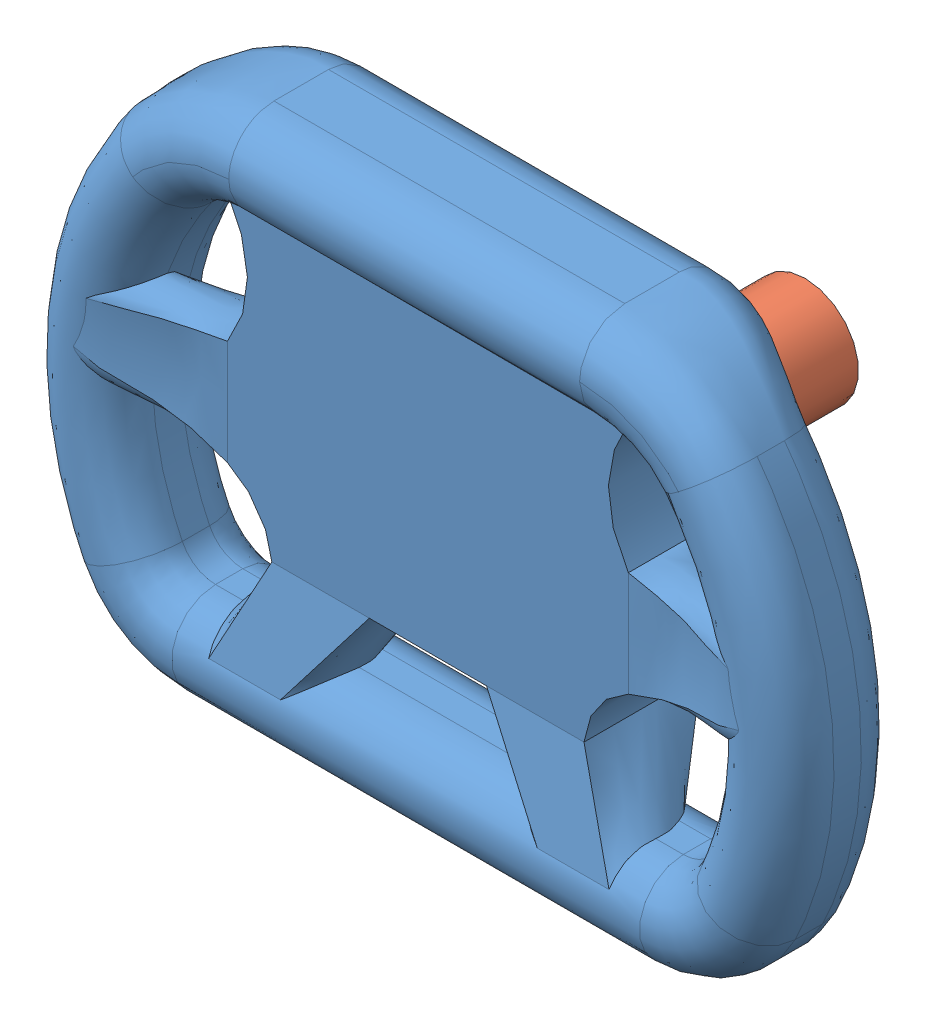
SolidWorks assembly Steering Wheel_Final.SLDASM, configuration Default (file format 13000). Lengths in mm.
Overall size (250.72 174.65 131.11).
2 component instances, 2 part files, 3 mates.
Components (placement in the parent):
- Steering Wheel Mold - CF_Final-1: Steering Wheel Mold - CF_Final.SLDPRT [Default] at origin size (250.72 174.65 64.37)
- Steering Wheel Connector_Final-1: Steering Wheel Connector_Final.SLDPRT [Default] at (0 0 -55.0672) x (1 0 0) z (0 1 0) size (63.5 66.75 63.5)
Mates (geometry in assembly coordinates):
- Concentric18: concentric: circle of Steering Wheel Mold - CF_Final-1; circle of Steering Wheel Connector_Final-1
- Coincident70: coincident: plane of Steering Wheel Connector_Final-1; plane of assembly through (0 0 0) normal (1 0 0)
- Coincident71: coincident: plane of Steering Wheel Mold - CF_Final-1 through (16.0923 18.9061 -45.974) normal (0 0 -1); plane of Steering Wheel Connector_Final-1 through (0 -63.3339 -45.974) normal (0 0 1)
